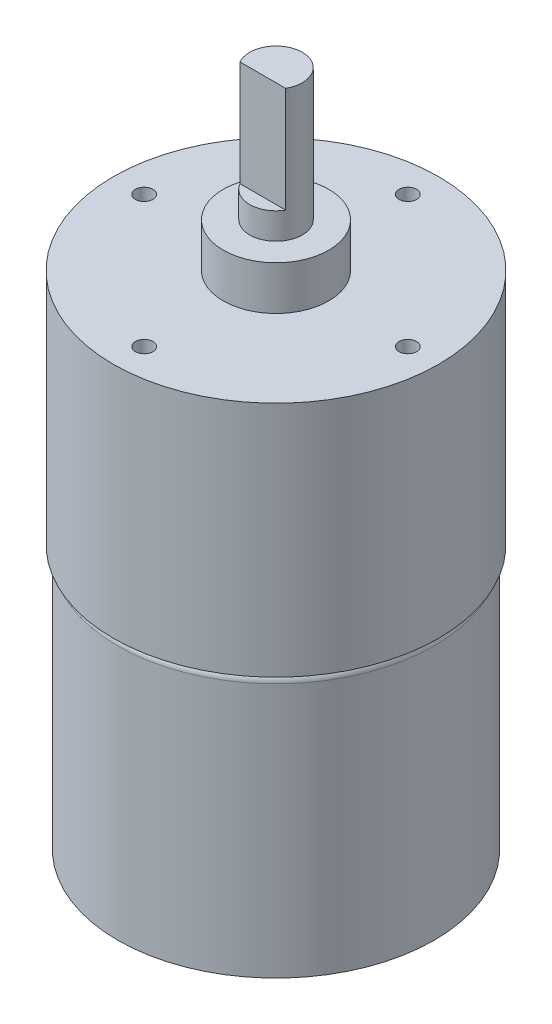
ISO-10303-21;
HEADER;
FILE_DESCRIPTION(('STEP AP214'),'2;1');
FILE_NAME('part.step','',(''),(''),'','','');
FILE_SCHEMA(('AUTOMOTIVE_DESIGN { 1 0 10303 214 1 1 1 1 }'));
ENDSEC;
DATA;
#1=APPLICATION_CONTEXT('core data for automotive mechanical design processes');
#2=APPLICATION_PROTOCOL_DEFINITION('international standard','automotive_design',2000,#1);
#3=PRODUCT_CONTEXT('',#1,'mechanical');
#4=PRODUCT('Part','Part','',(#3));
#5=PRODUCT_RELATED_PRODUCT_CATEGORY('part','',(#4));
#6=PRODUCT_DEFINITION_FORMATION('','',#4);
#7=PRODUCT_DEFINITION_CONTEXT('part definition',#1,'design');
#8=PRODUCT_DEFINITION('design','',#6,#7);
#9=PRODUCT_DEFINITION_SHAPE('','',#8);
#10=(LENGTH_UNIT() NAMED_UNIT(*) SI_UNIT(.MILLI.,.METRE.));
#11=(NAMED_UNIT(*) PLANE_ANGLE_UNIT() SI_UNIT($,.RADIAN.));
#12=(NAMED_UNIT(*) SI_UNIT($,.STERADIAN.) SOLID_ANGLE_UNIT());
#13=UNCERTAINTY_MEASURE_WITH_UNIT(LENGTH_MEASURE(1.E-05),#10,'distance_accuracy_value','');
#14=(GEOMETRIC_REPRESENTATION_CONTEXT(3) GLOBAL_UNCERTAINTY_ASSIGNED_CONTEXT((#13)) GLOBAL_UNIT_ASSIGNED_CONTEXT((#10,
#11,#12)) REPRESENTATION_CONTEXT('',''));
#15=CARTESIAN_POINT('',(0.,0.,0.));
#16=DIRECTION('',(0.,0.,1.));
#17=DIRECTION('',(1.,0.,0.));
#18=AXIS2_PLACEMENT_3D('',#15,#16,#17);
#19=CARTESIAN_POINT('',(3.5,-3.6,0.));
#20=DIRECTION('',(0.,1.,0.));
#21=DIRECTION('',(-1.,0.,0.));
#22=AXIS2_PLACEMENT_3D('',#19,#20,#21);
#23=PLANE('',#22);
#24=CARTESIAN_POINT('',(0.,-3.6,0.));
#25=DIRECTION('',(0.,1.,0.));
#26=DIRECTION('',(-1.,0.,0.));
#27=AXIS2_PLACEMENT_3D('',#24,#25,#26);
#28=CIRCLE('',#27,3.5);
#29=CARTESIAN_POINT('',(-3.5,-3.6,0.));
#30=VERTEX_POINT('',#29);
#31=EDGE_CURVE('E13',#30,#30,#28,.T.);
#32=ORIENTED_EDGE('',*,*,#31,.F.);
#33=EDGE_LOOP('',(#32));
#34=FACE_BOUND('',#33,.T.);
#35=ADVANCED_FACE('F58',(#34),#23,.F.);
#36=CARTESIAN_POINT('',(0.,0.,0.));
#37=DIRECTION('',(0.,1.,0.));
#38=DIRECTION('',(-1.,0.,0.));
#39=AXIS2_PLACEMENT_3D('',#36,#37,#38);
#40=CYLINDRICAL_SURFACE('',#39,3.5);
#41=CARTESIAN_POINT('',(0.,-4.,0.));
#42=DIRECTION('',(0.,1.,0.));
#43=DIRECTION('',(-1.,0.,0.));
#44=AXIS2_PLACEMENT_3D('',#41,#42,#43);
#45=CIRCLE('',#44,3.5);
#46=CARTESIAN_POINT('',(-3.5,-4.,0.));
#47=VERTEX_POINT('',#46);
#48=EDGE_CURVE('E64',#47,#47,#45,.T.);
#49=ORIENTED_EDGE('',*,*,#48,.F.);
#50=EDGE_LOOP('',(#49));
#51=FACE_BOUND('',#50,.T.);
#52=ORIENTED_EDGE('',*,*,#31,.T.);
#53=EDGE_LOOP('',(#52));
#54=FACE_BOUND('',#53,.T.);
#55=ADVANCED_FACE('F97',(#51,#54),#40,.F.);
#56=CARTESIAN_POINT('',(4.,-4.,0.));
#57=DIRECTION('',(0.,1.,0.));
#58=DIRECTION('',(-1.,0.,0.));
#59=AXIS2_PLACEMENT_3D('',#56,#57,#58);
#60=PLANE('',#59);
#61=CARTESIAN_POINT('',(0.,-4.,0.));
#62=DIRECTION('',(0.,1.,0.));
#63=DIRECTION('',(-1.,0.,0.));
#64=AXIS2_PLACEMENT_3D('',#61,#62,#63);
#65=CIRCLE('',#64,4.);
#66=CARTESIAN_POINT('',(-4.,-4.,0.));
#67=VERTEX_POINT('',#66);
#68=EDGE_CURVE('E68',#67,#67,#65,.T.);
#69=ORIENTED_EDGE('',*,*,#68,.F.);
#70=EDGE_LOOP('',(#69));
#71=FACE_BOUND('',#70,.T.);
#72=ORIENTED_EDGE('',*,*,#48,.T.);
#73=EDGE_LOOP('',(#72));
#74=FACE_BOUND('',#73,.T.);
#75=ADVANCED_FACE('F92',(#71,#74),#60,.F.);
#76=CARTESIAN_POINT('',(0.,-4.,0.));
#77=DIRECTION('',(0.,1.,0.));
#78=DIRECTION('',(-1.,0.,0.));
#79=AXIS2_PLACEMENT_3D('',#76,#77,#78);
#80=CONICAL_SURFACE('',#79,4.,0.785398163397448);
#81=CARTESIAN_POINT('',(0.,-3.,0.));
#82=DIRECTION('',(0.,1.,0.));
#83=DIRECTION('',(-1.,0.,0.));
#84=AXIS2_PLACEMENT_3D('',#81,#82,#83);
#85=CIRCLE('',#84,5.);
#86=CARTESIAN_POINT('',(-5.,-3.,0.));
#87=VERTEX_POINT('',#86);
#88=EDGE_CURVE('E72',#87,#87,#85,.T.);
#89=ORIENTED_EDGE('',*,*,#88,.F.);
#90=EDGE_LOOP('',(#89));
#91=FACE_BOUND('',#90,.T.);
#92=ORIENTED_EDGE('',*,*,#68,.T.);
#93=EDGE_LOOP('',(#92));
#94=FACE_BOUND('',#93,.T.);
#95=ADVANCED_FACE('F86',(#91,#94),#80,.T.);
#96=CARTESIAN_POINT('',(0.,0.,0.));
#97=DIRECTION('',(0.,1.,0.));
#98=DIRECTION('',(-1.,0.,0.));
#99=AXIS2_PLACEMENT_3D('',#96,#97,#98);
#100=CYLINDRICAL_SURFACE('',#99,5.);
#101=CARTESIAN_POINT('',(0.,0.,0.));
#102=DIRECTION('',(0.,1.,0.));
#103=DIRECTION('',(-1.,0.,0.));
#104=AXIS2_PLACEMENT_3D('',#101,#102,#103);
#105=CIRCLE('',#104,5.);
#106=CARTESIAN_POINT('',(-5.,0.,0.));
#107=VERTEX_POINT('',#106);
#108=EDGE_CURVE('E77',#107,#107,#105,.T.);
#109=ORIENTED_EDGE('',*,*,#108,.F.);
#110=EDGE_LOOP('',(#109));
#111=FACE_BOUND('',#110,.T.);
#112=ORIENTED_EDGE('',*,*,#88,.T.);
#113=EDGE_LOOP('',(#112));
#114=FACE_BOUND('',#113,.T.);
#115=ADVANCED_FACE('F83',(#111,#114),#100,.T.);
#116=CARTESIAN_POINT('',(5.,0.,0.));
#117=DIRECTION('',(0.,-1.,0.));
#118=DIRECTION('',(1.,0.,0.));
#119=AXIS2_PLACEMENT_3D('',#116,#117,#118);
#120=PLANE('',#119);
#121=ORIENTED_EDGE('',*,*,#108,.T.);
#122=EDGE_LOOP('',(#121));
#123=FACE_BOUND('',#122,.T.);
#124=ADVANCED_FACE('F81',(#123),#120,.F.);
#125=CLOSED_SHELL('',(#35,#55,#75,#95,#115,#124));
#126=MANIFOLD_SOLID_BREP('B2',#125);
#127=CARTESIAN_POINT('',(0.,30.,0.));
#128=DIRECTION('',(0.,-1.,0.));
#129=DIRECTION('',(0.,0.,-1.));
#130=AXIS2_PLACEMENT_3D('',#127,#128,#129);
#131=CYLINDRICAL_SURFACE('',#130,18.);
#132=CARTESIAN_POINT('',(0.,29.,0.));
#133=DIRECTION('',(0.,1.,0.));
#134=DIRECTION('',(0.,0.,1.));
#135=AXIS2_PLACEMENT_3D('',#132,#133,#134);
#136=CIRCLE('',#135,18.);
#137=CARTESIAN_POINT('',(0.,29.,18.));
#138=VERTEX_POINT('',#137);
#139=EDGE_CURVE('E157',#138,#138,#136,.F.);
#140=ORIENTED_EDGE('',*,*,#139,.T.);
#141=EDGE_LOOP('',(#140));
#142=FACE_BOUND('',#141,.T.);
#143=CARTESIAN_POINT('',(0.,0.,0.));
#144=DIRECTION('',(0.,1.,0.));
#145=DIRECTION('',(0.,0.,1.));
#146=AXIS2_PLACEMENT_3D('',#143,#144,#145);
#147=CIRCLE('',#146,18.);
#148=CARTESIAN_POINT('',(0.,0.,18.));
#149=VERTEX_POINT('',#148);
#150=EDGE_CURVE('E442',#149,#149,#147,.T.);
#151=ORIENTED_EDGE('',*,*,#150,.T.);
#152=EDGE_LOOP('',(#151));
#153=FACE_BOUND('',#152,.T.);
#154=ADVANCED_FACE('F149',(#142,#153),#131,.T.);
#155=CARTESIAN_POINT('',(0.,0.,0.));
#156=DIRECTION('',(0.,1.,0.));
#157=DIRECTION('',(0.,0.,1.));
#158=AXIS2_PLACEMENT_3D('',#155,#156,#157);
#159=PLANE('',#158);
#160=CARTESIAN_POINT('',(0.,0.,0.));
#161=DIRECTION('',(0.,-1.,0.));
#162=DIRECTION('',(0.,0.,-1.));
#163=AXIS2_PLACEMENT_3D('',#160,#161,#162);
#164=CIRCLE('',#163,17.5);
#165=CARTESIAN_POINT('',(0.,0.,-17.5));
#166=VERTEX_POINT('',#165);
#167=EDGE_CURVE('E438',#166,#166,#164,.T.);
#168=ORIENTED_EDGE('',*,*,#167,.F.);
#169=EDGE_LOOP('',(#168));
#170=FACE_BOUND('',#169,.T.);
#171=ORIENTED_EDGE('',*,*,#150,.F.);
#172=EDGE_LOOP('',(#171));
#173=FACE_BOUND('',#172,.T.);
#174=ADVANCED_FACE('F547',(#170,#173),#159,.F.);
#175=CARTESIAN_POINT('',(0.,1.,0.));
#176=DIRECTION('',(0.,-1.,0.));
#177=DIRECTION('',(0.,0.,-1.));
#178=AXIS2_PLACEMENT_3D('',#175,#176,#177);
#179=CYLINDRICAL_SURFACE('',#178,17.5);
#180=CARTESIAN_POINT('',(0.,1.,0.));
#181=DIRECTION('',(0.,-1.,0.));
#182=DIRECTION('',(0.,0.,-1.));
#183=AXIS2_PLACEMENT_3D('',#180,#181,#182);
#184=CIRCLE('',#183,17.5);
#185=CARTESIAN_POINT('',(0.,1.,-17.5));
#186=VERTEX_POINT('',#185);
#187=EDGE_CURVE('E439',#186,#186,#184,.T.);
#188=ORIENTED_EDGE('',*,*,#187,.F.);
#189=EDGE_LOOP('',(#188));
#190=FACE_BOUND('',#189,.T.);
#191=ORIENTED_EDGE('',*,*,#167,.T.);
#192=EDGE_LOOP('',(#191));
#193=FACE_BOUND('',#192,.T.);
#194=ADVANCED_FACE('F552',(#190,#193),#179,.F.);
#195=CARTESIAN_POINT('',(0.,1.,0.));
#196=DIRECTION('',(0.,-1.,0.));
#197=DIRECTION('',(0.,0.,-1.));
#198=AXIS2_PLACEMENT_3D('',#195,#196,#197);
#199=PLANE('',#198);
#200=CARTESIAN_POINT('',(10.5,1.,3.));
#201=DIRECTION('',(0.,-1.,0.));
#202=DIRECTION('',(0.,0.,-1.));
#203=AXIS2_PLACEMENT_3D('',#200,#201,#202);
#204=CIRCLE('',#203,0.500000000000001);
#205=CARTESIAN_POINT('',(10.5,1.,2.5));
#206=VERTEX_POINT('',#205);
#207=EDGE_CURVE('E381',#206,#206,#204,.T.);
#208=ORIENTED_EDGE('',*,*,#207,.F.);
#209=EDGE_LOOP('',(#208));
#210=FACE_BOUND('',#209,.T.);
#211=CARTESIAN_POINT('',(10.5,1.,-2.99999999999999));
#212=DIRECTION('',(0.,-1.,0.));
#213=DIRECTION('',(0.,0.,-1.));
#214=AXIS2_PLACEMENT_3D('',#211,#212,#213);
#215=CIRCLE('',#214,0.500000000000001);
#216=CARTESIAN_POINT('',(10.5,1.,-3.49999999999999));
#217=VERTEX_POINT('',#216);
#218=EDGE_CURVE('E450',#217,#217,#215,.T.);
#219=ORIENTED_EDGE('',*,*,#218,.F.);
#220=EDGE_LOOP('',(#219));
#221=FACE_BOUND('',#220,.T.);
#222=CARTESIAN_POINT('',(-10.5,1.,-2.99999999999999));
#223=DIRECTION('',(0.,-1.,0.));
#224=DIRECTION('',(0.,0.,-1.));
#225=AXIS2_PLACEMENT_3D('',#222,#223,#224);
#226=CIRCLE('',#225,0.500000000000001);
#227=CARTESIAN_POINT('',(-10.5,1.,-3.49999999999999));
#228=VERTEX_POINT('',#227);
#229=EDGE_CURVE('E390',#228,#228,#226,.T.);
#230=ORIENTED_EDGE('',*,*,#229,.F.);
#231=EDGE_LOOP('',(#230));
#232=FACE_BOUND('',#231,.T.);
#233=CARTESIAN_POINT('',(-10.5,1.,3.));
#234=DIRECTION('',(0.,-1.,0.));
#235=DIRECTION('',(0.,0.,-1.));
#236=AXIS2_PLACEMENT_3D('',#233,#234,#235);
#237=CIRCLE('',#236,0.500000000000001);
#238=CARTESIAN_POINT('',(-10.5,1.,2.5));
#239=VERTEX_POINT('',#238);
#240=EDGE_CURVE('E447',#239,#239,#237,.T.);
#241=ORIENTED_EDGE('',*,*,#240,.F.);
#242=EDGE_LOOP('',(#241));
#243=FACE_BOUND('',#242,.T.);
#244=CARTESIAN_POINT('',(11.,1.,1.5));
#245=DIRECTION('',(0.,-1.,0.));
#246=DIRECTION('',(0.,0.,-1.));
#247=AXIS2_PLACEMENT_3D('',#244,#245,#246);
#248=CIRCLE('',#247,0.5);
#249=CARTESIAN_POINT('',(11.5,1.,1.5));
#250=VERTEX_POINT('',#249);
#251=CARTESIAN_POINT('',(10.5,1.,1.5));
#252=VERTEX_POINT('',#251);
#253=EDGE_CURVE('E401',#250,#252,#248,.T.);
#254=ORIENTED_EDGE('',*,*,#253,.F.);
#255=DIRECTION('',(0.,0.,1.));
#256=VECTOR('',#255,1.);
#257=CARTESIAN_POINT('',(11.5,1.,0.));
#258=LINE('',#257,#256);
#259=CARTESIAN_POINT('',(11.5,1.,-1.5));
#260=VERTEX_POINT('',#259);
#261=EDGE_CURVE('E398',#260,#250,#258,.T.);
#262=ORIENTED_EDGE('',*,*,#261,.F.);
#263=CARTESIAN_POINT('',(11.,1.,-1.5));
#264=DIRECTION('',(0.,-1.,0.));
#265=DIRECTION('',(0.,0.,-1.));
#266=AXIS2_PLACEMENT_3D('',#263,#264,#265);
#267=CIRCLE('',#266,0.5);
#268=CARTESIAN_POINT('',(10.5,1.,-1.5));
#269=VERTEX_POINT('',#268);
#270=EDGE_CURVE('E407',#269,#260,#267,.T.);
#271=ORIENTED_EDGE('',*,*,#270,.F.);
#272=DIRECTION('',(0.,0.,1.));
#273=VECTOR('',#272,1.);
#274=CARTESIAN_POINT('',(10.5,1.,0.));
#275=LINE('',#274,#273);
#276=EDGE_CURVE('E404',#269,#252,#275,.T.);
#277=ORIENTED_EDGE('',*,*,#276,.T.);
#278=EDGE_LOOP('',(#254,#262,#271,#277));
#279=FACE_BOUND('',#278,.T.);
#280=CARTESIAN_POINT('',(-11.,1.,1.5));
#281=DIRECTION('',(0.,-1.,0.));
#282=DIRECTION('',(0.,0.,-1.));
#283=AXIS2_PLACEMENT_3D('',#280,#281,#282);
#284=CIRCLE('',#283,0.5);
#285=CARTESIAN_POINT('',(-10.5,1.,1.5));
#286=VERTEX_POINT('',#285);
#287=CARTESIAN_POINT('',(-11.5,1.,1.5));
#288=VERTEX_POINT('',#287);
#289=EDGE_CURVE('E421',#286,#288,#284,.T.);
#290=ORIENTED_EDGE('',*,*,#289,.F.);
#291=DIRECTION('',(0.,0.,1.));
#292=VECTOR('',#291,1.);
#293=CARTESIAN_POINT('',(-10.5,1.,0.));
#294=LINE('',#293,#292);
#295=CARTESIAN_POINT('',(-10.5,1.,-1.5));
#296=VERTEX_POINT('',#295);
#297=EDGE_CURVE('E418',#296,#286,#294,.T.);
#298=ORIENTED_EDGE('',*,*,#297,.F.);
#299=CARTESIAN_POINT('',(-11.,1.,-1.5));
#300=DIRECTION('',(0.,-1.,0.));
#301=DIRECTION('',(0.,0.,-1.));
#302=AXIS2_PLACEMENT_3D('',#299,#300,#301);
#303=CIRCLE('',#302,0.5);
#304=CARTESIAN_POINT('',(-11.5,1.,-1.5));
#305=VERTEX_POINT('',#304);
#306=EDGE_CURVE('E427',#305,#296,#303,.T.);
#307=ORIENTED_EDGE('',*,*,#306,.F.);
#308=DIRECTION('',(0.,0.,1.));
#309=VECTOR('',#308,1.);
#310=CARTESIAN_POINT('',(-11.5,1.,0.));
#311=LINE('',#310,#309);
#312=EDGE_CURVE('E424',#305,#288,#311,.T.);
#313=ORIENTED_EDGE('',*,*,#312,.T.);
#314=EDGE_LOOP('',(#290,#298,#307,#313));
#315=FACE_BOUND('',#314,.T.);
#316=ORIENTED_EDGE('',*,*,#187,.T.);
#317=EDGE_LOOP('',(#316));
#318=FACE_BOUND('',#317,.T.);
#319=ADVANCED_FACE('F614',(#210,#221,#232,#243,#279,#315,#318),#199,.T.);
#320=CARTESIAN_POINT('',(-10.5,-5.,0.));
#321=DIRECTION('',(-1.,0.,0.));
#322=DIRECTION('',(0.,0.,1.));
#323=AXIS2_PLACEMENT_3D('',#320,#321,#322);
#324=PLANE('',#323);
#325=CARTESIAN_POINT('',(-10.5,-3.25,0.));
#326=DIRECTION('',(-1.,0.,0.));
#327=DIRECTION('',(0.,0.,1.));
#328=AXIS2_PLACEMENT_3D('',#325,#326,#327);
#329=CIRCLE('',#328,0.5);
#330=CARTESIAN_POINT('',(-10.5,-3.25,-0.5));
#331=VERTEX_POINT('',#330);
#332=CARTESIAN_POINT('',(-10.5,-3.25,0.499999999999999));
#333=VERTEX_POINT('',#332);
#334=EDGE_CURVE('E354',#331,#333,#329,.T.);
#335=ORIENTED_EDGE('',*,*,#334,.T.);
#336=DIRECTION('',(0.,1.,0.));
#337=VECTOR('',#336,1.);
#338=CARTESIAN_POINT('',(-10.5,-5.,0.499999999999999));
#339=LINE('',#338,#337);
#340=CARTESIAN_POINT('',(-10.5,-1.75,0.5));
#341=VERTEX_POINT('',#340);
#342=EDGE_CURVE('E377',#333,#341,#339,.T.);
#343=ORIENTED_EDGE('',*,*,#342,.T.);
#344=CARTESIAN_POINT('',(-10.5,-1.75,0.));
#345=DIRECTION('',(-1.,0.,0.));
#346=DIRECTION('',(0.,0.,1.));
#347=AXIS2_PLACEMENT_3D('',#344,#345,#346);
#348=CIRCLE('',#347,0.5);
#349=CARTESIAN_POINT('',(-10.5,-1.75,-0.499999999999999));
#350=VERTEX_POINT('',#349);
#351=EDGE_CURVE('E369',#341,#350,#348,.T.);
#352=ORIENTED_EDGE('',*,*,#351,.T.);
#353=DIRECTION('',(0.,1.,0.));
#354=VECTOR('',#353,1.);
#355=CARTESIAN_POINT('',(-10.5,-5.,-0.5));
#356=LINE('',#355,#354);
#357=EDGE_CURVE('E362',#331,#350,#356,.T.);
#358=ORIENTED_EDGE('',*,*,#357,.F.);
#359=EDGE_LOOP('',(#335,#343,#352,#358));
#360=FACE_BOUND('',#359,.T.);
#361=DIRECTION('',(0.,1.,0.));
#362=VECTOR('',#361,1.);
#363=CARTESIAN_POINT('',(-10.5,-5.,1.5));
#364=LINE('',#363,#362);
#365=CARTESIAN_POINT('',(-10.5,-4.9,1.5));
#366=VERTEX_POINT('',#365);
#367=EDGE_CURVE('E436',#366,#286,#364,.T.);
#368=ORIENTED_EDGE('',*,*,#367,.F.);
#369=DIRECTION('',(0.,0.,-1.));
#370=VECTOR('',#369,1.);
#371=CARTESIAN_POINT('',(-10.5,-4.9,-1.5));
#372=LINE('',#371,#370);
#373=CARTESIAN_POINT('',(-10.5,-4.9,-1.5));
#374=VERTEX_POINT('',#373);
#375=EDGE_CURVE('E478',#366,#374,#372,.T.);
#376=ORIENTED_EDGE('',*,*,#375,.T.);
#377=DIRECTION('',(0.,1.,0.));
#378=VECTOR('',#377,1.);
#379=CARTESIAN_POINT('',(-10.5,-5.,-1.5));
#380=LINE('',#379,#378);
#381=EDGE_CURVE('E430',#374,#296,#380,.T.);
#382=ORIENTED_EDGE('',*,*,#381,.T.);
#383=ORIENTED_EDGE('',*,*,#297,.T.);
#384=EDGE_LOOP('',(#368,#376,#382,#383));
#385=FACE_BOUND('',#384,.T.);
#386=ADVANCED_FACE('F617',(#360,#385),#324,.F.);
#387=CARTESIAN_POINT('',(-11.,-5.,1.5));
#388=DIRECTION('',(0.,1.,0.));
#389=DIRECTION('',(0.,0.,1.));
#390=AXIS2_PLACEMENT_3D('',#387,#388,#389);
#391=CYLINDRICAL_SURFACE('',#390,0.5);
#392=DIRECTION('',(0.,1.,0.));
#393=VECTOR('',#392,1.);
#394=CARTESIAN_POINT('',(-11.5,-5.,1.5));
#395=LINE('',#394,#393);
#396=CARTESIAN_POINT('',(-11.5,-4.9,1.5));
#397=VERTEX_POINT('',#396);
#398=EDGE_CURVE('E434',#397,#288,#395,.T.);
#399=ORIENTED_EDGE('',*,*,#398,.F.);
#400=CARTESIAN_POINT('',(-11.,-4.9,1.5));
#401=DIRECTION('',(0.,-1.,0.));
#402=DIRECTION('',(0.,0.,-1.));
#403=AXIS2_PLACEMENT_3D('',#400,#401,#402);
#404=CIRCLE('',#403,0.5);
#405=EDGE_CURVE('E476',#397,#366,#404,.F.);
#406=ORIENTED_EDGE('',*,*,#405,.T.);
#407=ORIENTED_EDGE('',*,*,#367,.T.);
#408=ORIENTED_EDGE('',*,*,#289,.T.);
#409=EDGE_LOOP('',(#399,#406,#407,#408));
#410=FACE_BOUND('',#409,.T.);
#411=ADVANCED_FACE('F635',(#410),#391,.T.);
#412=CARTESIAN_POINT('',(-11.5,-5.,0.));
#413=DIRECTION('',(-1.,0.,0.));
#414=DIRECTION('',(0.,0.,1.));
#415=AXIS2_PLACEMENT_3D('',#412,#413,#414);
#416=PLANE('',#415);
#417=DIRECTION('',(0.,1.,0.));
#418=VECTOR('',#417,1.);
#419=CARTESIAN_POINT('',(-11.5,-5.,0.499999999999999));
#420=LINE('',#419,#418);
#421=CARTESIAN_POINT('',(-11.5,-3.25,0.499999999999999));
#422=VERTEX_POINT('',#421);
#423=CARTESIAN_POINT('',(-11.5,-1.75,0.5));
#424=VERTEX_POINT('',#423);
#425=EDGE_CURVE('E375',#422,#424,#420,.T.);
#426=ORIENTED_EDGE('',*,*,#425,.F.);
#427=CARTESIAN_POINT('',(-11.5,-3.25,0.));
#428=DIRECTION('',(-1.,0.,0.));
#429=DIRECTION('',(0.,0.,1.));
#430=AXIS2_PLACEMENT_3D('',#427,#428,#429);
#431=CIRCLE('',#430,0.5);
#432=CARTESIAN_POINT('',(-11.5,-3.25,-0.5));
#433=VERTEX_POINT('',#432);
#434=EDGE_CURVE('E352',#433,#422,#431,.T.);
#435=ORIENTED_EDGE('',*,*,#434,.F.);
#436=DIRECTION('',(0.,1.,0.));
#437=VECTOR('',#436,1.);
#438=CARTESIAN_POINT('',(-11.5,-5.,-0.5));
#439=LINE('',#438,#437);
#440=CARTESIAN_POINT('',(-11.5,-1.75,-0.499999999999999));
#441=VERTEX_POINT('',#440);
#442=EDGE_CURVE('E359',#433,#441,#439,.T.);
#443=ORIENTED_EDGE('',*,*,#442,.T.);
#444=CARTESIAN_POINT('',(-11.5,-1.75,0.));
#445=DIRECTION('',(-1.,0.,0.));
#446=DIRECTION('',(0.,0.,1.));
#447=AXIS2_PLACEMENT_3D('',#444,#445,#446);
#448=CIRCLE('',#447,0.5);
#449=EDGE_CURVE('E367',#424,#441,#448,.T.);
#450=ORIENTED_EDGE('',*,*,#449,.F.);
#451=EDGE_LOOP('',(#426,#435,#443,#450));
#452=FACE_BOUND('',#451,.T.);
#453=DIRECTION('',(0.,1.,0.));
#454=VECTOR('',#453,1.);
#455=CARTESIAN_POINT('',(-11.5,-5.,-1.5));
#456=LINE('',#455,#454);
#457=CARTESIAN_POINT('',(-11.5,-4.9,-1.5));
#458=VERTEX_POINT('',#457);
#459=EDGE_CURVE('E432',#458,#305,#456,.T.);
#460=ORIENTED_EDGE('',*,*,#459,.F.);
#461=DIRECTION('',(0.,0.,1.));
#462=VECTOR('',#461,1.);
#463=CARTESIAN_POINT('',(-11.5,-4.9,0.));
#464=LINE('',#463,#462);
#465=EDGE_CURVE('E474',#458,#397,#464,.T.);
#466=ORIENTED_EDGE('',*,*,#465,.T.);
#467=ORIENTED_EDGE('',*,*,#398,.T.);
#468=ORIENTED_EDGE('',*,*,#312,.F.);
#469=EDGE_LOOP('',(#460,#466,#467,#468));
#470=FACE_BOUND('',#469,.T.);
#471=ADVANCED_FACE('F639',(#452,#470),#416,.T.);
#472=CARTESIAN_POINT('',(-11.,-5.,-1.5));
#473=DIRECTION('',(0.,1.,0.));
#474=DIRECTION('',(0.,0.,1.));
#475=AXIS2_PLACEMENT_3D('',#472,#473,#474);
#476=CYLINDRICAL_SURFACE('',#475,0.5);
#477=ORIENTED_EDGE('',*,*,#381,.F.);
#478=CARTESIAN_POINT('',(-11.,-4.9,-1.5));
#479=DIRECTION('',(0.,-1.,0.));
#480=DIRECTION('',(0.,0.,-1.));
#481=AXIS2_PLACEMENT_3D('',#478,#479,#480);
#482=CIRCLE('',#481,0.5);
#483=EDGE_CURVE('E471',#374,#458,#482,.F.);
#484=ORIENTED_EDGE('',*,*,#483,.T.);
#485=ORIENTED_EDGE('',*,*,#459,.T.);
#486=ORIENTED_EDGE('',*,*,#306,.T.);
#487=EDGE_LOOP('',(#477,#484,#485,#486));
#488=FACE_BOUND('',#487,.T.);
#489=ADVANCED_FACE('F643',(#488),#476,.T.);
#490=CARTESIAN_POINT('',(0.,-5.,0.));
#491=DIRECTION('',(0.,-1.,0.));
#492=DIRECTION('',(0.,0.,-1.));
#493=AXIS2_PLACEMENT_3D('',#490,#491,#492);
#494=PLANE('',#493);
#495=DIRECTION('',(0.,0.,-1.));
#496=VECTOR('',#495,1.);
#497=CARTESIAN_POINT('',(-11.4,-5.,0.));
#498=LINE('',#497,#496);
#499=CARTESIAN_POINT('',(-11.4,-5.,1.5));
#500=VERTEX_POINT('',#499);
#501=CARTESIAN_POINT('',(-11.4,-5.,-1.5));
#502=VERTEX_POINT('',#501);
#503=EDGE_CURVE('E466',#500,#502,#498,.T.);
#504=ORIENTED_EDGE('',*,*,#503,.T.);
#505=CARTESIAN_POINT('',(-11.,-5.,-1.5));
#506=DIRECTION('',(0.,-1.,0.));
#507=DIRECTION('',(0.,0.,-1.));
#508=AXIS2_PLACEMENT_3D('',#505,#506,#507);
#509=CIRCLE('',#508,0.399999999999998);
#510=CARTESIAN_POINT('',(-10.6,-5.,-1.5));
#511=VERTEX_POINT('',#510);
#512=EDGE_CURVE('E468',#502,#511,#509,.T.);
#513=ORIENTED_EDGE('',*,*,#512,.T.);
#514=DIRECTION('',(0.,0.,1.));
#515=VECTOR('',#514,1.);
#516=CARTESIAN_POINT('',(-10.6,-5.,1.5));
#517=LINE('',#516,#515);
#518=CARTESIAN_POINT('',(-10.6,-5.,1.5));
#519=VERTEX_POINT('',#518);
#520=EDGE_CURVE('E462',#511,#519,#517,.T.);
#521=ORIENTED_EDGE('',*,*,#520,.T.);
#522=CARTESIAN_POINT('',(-11.,-5.,1.5));
#523=DIRECTION('',(0.,-1.,0.));
#524=DIRECTION('',(0.,0.,-1.));
#525=AXIS2_PLACEMENT_3D('',#522,#523,#524);
#526=CIRCLE('',#525,0.399999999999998);
#527=EDGE_CURVE('E464',#519,#500,#526,.T.);
#528=ORIENTED_EDGE('',*,*,#527,.T.);
#529=EDGE_LOOP('',(#504,#513,#521,#528));
#530=FACE_BOUND('',#529,.T.);
#531=ADVANCED_FACE('F647',(#530),#494,.T.);
#532=CARTESIAN_POINT('',(11.5,-5.,0.));
#533=DIRECTION('',(-1.,0.,0.));
#534=DIRECTION('',(0.,0.,1.));
#535=AXIS2_PLACEMENT_3D('',#532,#533,#534);
#536=PLANE('',#535);
#537=CARTESIAN_POINT('',(11.5,-3.25,0.));
#538=DIRECTION('',(-1.,0.,0.));
#539=DIRECTION('',(0.,0.,1.));
#540=AXIS2_PLACEMENT_3D('',#537,#538,#539);
#541=CIRCLE('',#540,0.5);
#542=CARTESIAN_POINT('',(11.5,-3.25,-0.5));
#543=VERTEX_POINT('',#542);
#544=CARTESIAN_POINT('',(11.5,-3.25,0.499999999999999));
#545=VERTEX_POINT('',#544);
#546=EDGE_CURVE('E349',#543,#545,#541,.T.);
#547=ORIENTED_EDGE('',*,*,#546,.T.);
#548=DIRECTION('',(0.,1.,0.));
#549=VECTOR('',#548,1.);
#550=CARTESIAN_POINT('',(11.5,-5.,0.499999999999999));
#551=LINE('',#550,#549);
#552=CARTESIAN_POINT('',(11.5,-1.75,0.5));
#553=VERTEX_POINT('',#552);
#554=EDGE_CURVE('E372',#545,#553,#551,.T.);
#555=ORIENTED_EDGE('',*,*,#554,.T.);
#556=CARTESIAN_POINT('',(11.5,-1.75,0.));
#557=DIRECTION('',(-1.,0.,0.));
#558=DIRECTION('',(0.,0.,1.));
#559=AXIS2_PLACEMENT_3D('',#556,#557,#558);
#560=CIRCLE('',#559,0.5);
#561=CARTESIAN_POINT('',(11.5,-1.75,-0.499999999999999));
#562=VERTEX_POINT('',#561);
#563=EDGE_CURVE('E364',#553,#562,#560,.T.);
#564=ORIENTED_EDGE('',*,*,#563,.T.);
#565=DIRECTION('',(0.,1.,0.));
#566=VECTOR('',#565,1.);
#567=CARTESIAN_POINT('',(11.5,-5.,-0.5));
#568=LINE('',#567,#566);
#569=EDGE_CURVE('E357',#543,#562,#568,.T.);
#570=ORIENTED_EDGE('',*,*,#569,.F.);
#571=EDGE_LOOP('',(#547,#555,#564,#570));
#572=FACE_BOUND('',#571,.T.);
#573=DIRECTION('',(0.,1.,0.));
#574=VECTOR('',#573,1.);
#575=CARTESIAN_POINT('',(11.5,-5.,1.5));
#576=LINE('',#575,#574);
#577=CARTESIAN_POINT('',(11.5,-4.90000000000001,1.5));
#578=VERTEX_POINT('',#577);
#579=EDGE_CURVE('E416',#578,#250,#576,.T.);
#580=ORIENTED_EDGE('',*,*,#579,.F.);
#581=DIRECTION('',(0.,0.,-1.));
#582=VECTOR('',#581,1.);
#583=CARTESIAN_POINT('',(11.5,-4.90000000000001,-1.5));
#584=LINE('',#583,#582);
#585=CARTESIAN_POINT('',(11.5,-4.90000000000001,-1.5));
#586=VERTEX_POINT('',#585);
#587=EDGE_CURVE('E495',#578,#586,#584,.T.);
#588=ORIENTED_EDGE('',*,*,#587,.T.);
#589=DIRECTION('',(0.,1.,0.));
#590=VECTOR('',#589,1.);
#591=CARTESIAN_POINT('',(11.5,-5.,-1.5));
#592=LINE('',#591,#590);
#593=EDGE_CURVE('E410',#586,#260,#592,.T.);
#594=ORIENTED_EDGE('',*,*,#593,.T.);
#595=ORIENTED_EDGE('',*,*,#261,.T.);
#596=EDGE_LOOP('',(#580,#588,#594,#595));
#597=FACE_BOUND('',#596,.T.);
#598=ADVANCED_FACE('F597',(#572,#597),#536,.F.);
#599=CARTESIAN_POINT('',(11.,-5.,1.5));
#600=DIRECTION('',(0.,1.,0.));
#601=DIRECTION('',(0.,0.,1.));
#602=AXIS2_PLACEMENT_3D('',#599,#600,#601);
#603=CYLINDRICAL_SURFACE('',#602,0.5);
#604=DIRECTION('',(0.,1.,0.));
#605=VECTOR('',#604,1.);
#606=CARTESIAN_POINT('',(10.5,-5.,1.5));
#607=LINE('',#606,#605);
#608=CARTESIAN_POINT('',(10.5,-4.90000000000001,1.5));
#609=VERTEX_POINT('',#608);
#610=EDGE_CURVE('E414',#609,#252,#607,.T.);
#611=ORIENTED_EDGE('',*,*,#610,.F.);
#612=CARTESIAN_POINT('',(11.,-4.90000000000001,1.5));
#613=DIRECTION('',(0.,-1.,0.));
#614=DIRECTION('',(0.,0.,-1.));
#615=AXIS2_PLACEMENT_3D('',#612,#613,#614);
#616=CIRCLE('',#615,0.5);
#617=EDGE_CURVE('E172',#609,#578,#616,.F.);
#618=ORIENTED_EDGE('',*,*,#617,.T.);
#619=ORIENTED_EDGE('',*,*,#579,.T.);
#620=ORIENTED_EDGE('',*,*,#253,.T.);
#621=EDGE_LOOP('',(#611,#618,#619,#620));
#622=FACE_BOUND('',#621,.T.);
#623=ADVANCED_FACE('F611',(#622),#603,.T.);
#624=CARTESIAN_POINT('',(10.5,-5.,0.));
#625=DIRECTION('',(-1.,0.,0.));
#626=DIRECTION('',(0.,0.,1.));
#627=AXIS2_PLACEMENT_3D('',#624,#625,#626);
#628=PLANE('',#627);
#629=DIRECTION('',(0.,1.,0.));
#630=VECTOR('',#629,1.);
#631=CARTESIAN_POINT('',(10.5,-5.,0.499999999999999));
#632=LINE('',#631,#630);
#633=CARTESIAN_POINT('',(10.5,-3.25,0.499999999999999));
#634=VERTEX_POINT('',#633);
#635=CARTESIAN_POINT('',(10.5,-1.75,0.5));
#636=VERTEX_POINT('',#635);
#637=EDGE_CURVE('E460',#634,#636,#632,.T.);
#638=ORIENTED_EDGE('',*,*,#637,.F.);
#639=CARTESIAN_POINT('',(10.5,-3.25,0.));
#640=DIRECTION('',(-1.,0.,0.));
#641=DIRECTION('',(0.,0.,1.));
#642=AXIS2_PLACEMENT_3D('',#639,#640,#641);
#643=CIRCLE('',#642,0.5);
#644=CARTESIAN_POINT('',(10.5,-3.25,-0.5));
#645=VERTEX_POINT('',#644);
#646=EDGE_CURVE('E453',#645,#634,#643,.T.);
#647=ORIENTED_EDGE('',*,*,#646,.F.);
#648=DIRECTION('',(0.,1.,0.));
#649=VECTOR('',#648,1.);
#650=CARTESIAN_POINT('',(10.5,-5.,-0.5));
#651=LINE('',#650,#649);
#652=CARTESIAN_POINT('',(10.5,-1.75,-0.499999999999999));
#653=VERTEX_POINT('',#652);
#654=EDGE_CURVE('E455',#645,#653,#651,.T.);
#655=ORIENTED_EDGE('',*,*,#654,.T.);
#656=CARTESIAN_POINT('',(10.5,-1.75,0.));
#657=DIRECTION('',(-1.,0.,0.));
#658=DIRECTION('',(0.,0.,1.));
#659=AXIS2_PLACEMENT_3D('',#656,#657,#658);
#660=CIRCLE('',#659,0.5);
#661=EDGE_CURVE('E458',#636,#653,#660,.T.);
#662=ORIENTED_EDGE('',*,*,#661,.F.);
#663=EDGE_LOOP('',(#638,#647,#655,#662));
#664=FACE_BOUND('',#663,.T.);
#665=DIRECTION('',(0.,1.,0.));
#666=VECTOR('',#665,1.);
#667=CARTESIAN_POINT('',(10.5,-5.,-1.5));
#668=LINE('',#667,#666);
#669=CARTESIAN_POINT('',(10.5,-4.90000000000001,-1.5));
#670=VERTEX_POINT('',#669);
#671=EDGE_CURVE('E412',#670,#269,#668,.T.);
#672=ORIENTED_EDGE('',*,*,#671,.F.);
#673=DIRECTION('',(0.,0.,1.));
#674=VECTOR('',#673,1.);
#675=CARTESIAN_POINT('',(10.5,-4.90000000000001,0.));
#676=LINE('',#675,#674);
#677=EDGE_CURVE('E492',#670,#609,#676,.T.);
#678=ORIENTED_EDGE('',*,*,#677,.T.);
#679=ORIENTED_EDGE('',*,*,#610,.T.);
#680=ORIENTED_EDGE('',*,*,#276,.F.);
#681=EDGE_LOOP('',(#672,#678,#679,#680));
#682=FACE_BOUND('',#681,.T.);
#683=ADVANCED_FACE('F609',(#664,#682),#628,.T.);
#684=CARTESIAN_POINT('',(11.,-5.,-1.5));
#685=DIRECTION('',(0.,1.,0.));
#686=DIRECTION('',(0.,0.,1.));
#687=AXIS2_PLACEMENT_3D('',#684,#685,#686);
#688=CYLINDRICAL_SURFACE('',#687,0.5);
#689=ORIENTED_EDGE('',*,*,#593,.F.);
#690=CARTESIAN_POINT('',(11.,-4.90000000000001,-1.5));
#691=DIRECTION('',(0.,-1.,0.));
#692=DIRECTION('',(0.,0.,-1.));
#693=AXIS2_PLACEMENT_3D('',#690,#691,#692);
#694=CIRCLE('',#693,0.5);
#695=EDGE_CURVE('E489',#586,#670,#694,.F.);
#696=ORIENTED_EDGE('',*,*,#695,.T.);
#697=ORIENTED_EDGE('',*,*,#671,.T.);
#698=ORIENTED_EDGE('',*,*,#270,.T.);
#699=EDGE_LOOP('',(#689,#696,#697,#698));
#700=FACE_BOUND('',#699,.T.);
#701=ADVANCED_FACE('F600',(#700),#688,.T.);
#702=CARTESIAN_POINT('',(0.,-5.,0.));
#703=DIRECTION('',(0.,-1.,0.));
#704=DIRECTION('',(0.,0.,-1.));
#705=AXIS2_PLACEMENT_3D('',#702,#703,#704);
#706=PLANE('',#705);
#707=DIRECTION('',(0.,0.,-1.));
#708=VECTOR('',#707,1.);
#709=CARTESIAN_POINT('',(10.6,-5.,0.));
#710=LINE('',#709,#708);
#711=CARTESIAN_POINT('',(10.6,-5.,1.5));
#712=VERTEX_POINT('',#711);
#713=CARTESIAN_POINT('',(10.6,-5.,-1.5));
#714=VERTEX_POINT('',#713);
#715=EDGE_CURVE('E484',#712,#714,#710,.T.);
#716=ORIENTED_EDGE('',*,*,#715,.T.);
#717=CARTESIAN_POINT('',(11.,-5.,-1.5));
#718=DIRECTION('',(0.,-1.,0.));
#719=DIRECTION('',(0.,0.,-1.));
#720=AXIS2_PLACEMENT_3D('',#717,#718,#719);
#721=CIRCLE('',#720,0.400000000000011);
#722=CARTESIAN_POINT('',(11.4,-5.,-1.5));
#723=VERTEX_POINT('',#722);
#724=EDGE_CURVE('E486',#714,#723,#721,.T.);
#725=ORIENTED_EDGE('',*,*,#724,.T.);
#726=DIRECTION('',(0.,0.,1.));
#727=VECTOR('',#726,1.);
#728=CARTESIAN_POINT('',(11.4,-5.,1.5));
#729=LINE('',#728,#727);
#730=CARTESIAN_POINT('',(11.4,-5.,1.5));
#731=VERTEX_POINT('',#730);
#732=EDGE_CURVE('E480',#723,#731,#729,.T.);
#733=ORIENTED_EDGE('',*,*,#732,.T.);
#734=CARTESIAN_POINT('',(11.,-5.,1.5));
#735=DIRECTION('',(0.,-1.,0.));
#736=DIRECTION('',(0.,0.,-1.));
#737=AXIS2_PLACEMENT_3D('',#734,#735,#736);
#738=CIRCLE('',#737,0.400000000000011);
#739=EDGE_CURVE('E482',#731,#712,#738,.T.);
#740=ORIENTED_EDGE('',*,*,#739,.T.);
#741=EDGE_LOOP('',(#716,#725,#733,#740));
#742=FACE_BOUND('',#741,.T.);
#743=ADVANCED_FACE('F662',(#742),#706,.T.);
#744=CARTESIAN_POINT('',(-10.5,0.5,3.));
#745=DIRECTION('',(0.,1.,0.));
#746=DIRECTION('',(0.,0.,1.));
#747=AXIS2_PLACEMENT_3D('',#744,#745,#746);
#748=CYLINDRICAL_SURFACE('',#747,0.500000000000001);
#749=CARTESIAN_POINT('',(-10.5,0.5,3.));
#750=DIRECTION('',(0.,1.,0.));
#751=DIRECTION('',(0.,0.,1.));
#752=AXIS2_PLACEMENT_3D('',#749,#750,#751);
#753=CIRCLE('',#752,0.500000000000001);
#754=CARTESIAN_POINT('',(-10.5,0.5,3.5));
#755=VERTEX_POINT('',#754);
#756=EDGE_CURVE('E393',#755,#755,#753,.T.);
#757=ORIENTED_EDGE('',*,*,#756,.T.);
#758=EDGE_LOOP('',(#757));
#759=FACE_BOUND('',#758,.T.);
#760=ORIENTED_EDGE('',*,*,#240,.T.);
#761=EDGE_LOOP('',(#760));
#762=FACE_BOUND('',#761,.T.);
#763=ADVANCED_FACE('F665',(#759,#762),#748,.T.);
#764=CARTESIAN_POINT('',(-10.5,0.5,3.));
#765=DIRECTION('',(0.,1.,0.));
#766=DIRECTION('',(0.,0.,1.));
#767=AXIS2_PLACEMENT_3D('',#764,#765,#766);
#768=PLANE('',#767);
#769=ORIENTED_EDGE('',*,*,#756,.F.);
#770=EDGE_LOOP('',(#769));
#771=FACE_BOUND('',#770,.T.);
#772=ADVANCED_FACE('F669',(#771),#768,.F.);
#773=CARTESIAN_POINT('',(-10.5,0.5,-2.99999999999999));
#774=DIRECTION('',(0.,1.,0.));
#775=DIRECTION('',(0.,0.,1.));
#776=AXIS2_PLACEMENT_3D('',#773,#774,#775);
#777=CYLINDRICAL_SURFACE('',#776,0.500000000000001);
#778=CARTESIAN_POINT('',(-10.5,0.5,-2.99999999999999));
#779=DIRECTION('',(0.,-1.,0.));
#780=DIRECTION('',(0.,0.,-1.));
#781=AXIS2_PLACEMENT_3D('',#778,#779,#780);
#782=CIRCLE('',#781,0.500000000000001);
#783=CARTESIAN_POINT('',(-10.5,0.5,-3.49999999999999));
#784=VERTEX_POINT('',#783);
#785=EDGE_CURVE('E389',#784,#784,#782,.T.);
#786=ORIENTED_EDGE('',*,*,#785,.F.);
#787=EDGE_LOOP('',(#786));
#788=FACE_BOUND('',#787,.T.);
#789=ORIENTED_EDGE('',*,*,#229,.T.);
#790=EDGE_LOOP('',(#789));
#791=FACE_BOUND('',#790,.T.);
#792=ADVANCED_FACE('F673',(#788,#791),#777,.T.);
#793=CARTESIAN_POINT('',(-10.5,0.5,-2.99999999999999));
#794=DIRECTION('',(0.,-1.,0.));
#795=DIRECTION('',(0.,0.,-1.));
#796=AXIS2_PLACEMENT_3D('',#793,#794,#795);
#797=PLANE('',#796);
#798=ORIENTED_EDGE('',*,*,#785,.T.);
#799=EDGE_LOOP('',(#798));
#800=FACE_BOUND('',#799,.T.);
#801=ADVANCED_FACE('F675',(#800),#797,.T.);
#802=CARTESIAN_POINT('',(10.5,0.5,-2.99999999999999));
#803=DIRECTION('',(0.,1.,0.));
#804=DIRECTION('',(0.,0.,1.));
#805=AXIS2_PLACEMENT_3D('',#802,#803,#804);
#806=CYLINDRICAL_SURFACE('',#805,0.500000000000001);
#807=CARTESIAN_POINT('',(10.5,0.5,-2.99999999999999));
#808=DIRECTION('',(0.,1.,0.));
#809=DIRECTION('',(0.,0.,1.));
#810=AXIS2_PLACEMENT_3D('',#807,#808,#809);
#811=CIRCLE('',#810,0.500000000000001);
#812=CARTESIAN_POINT('',(10.5,0.5,-2.49999999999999));
#813=VERTEX_POINT('',#812);
#814=EDGE_CURVE('E384',#813,#813,#811,.T.);
#815=ORIENTED_EDGE('',*,*,#814,.T.);
#816=EDGE_LOOP('',(#815));
#817=FACE_BOUND('',#816,.T.);
#818=ORIENTED_EDGE('',*,*,#218,.T.);
#819=EDGE_LOOP('',(#818));
#820=FACE_BOUND('',#819,.T.);
#821=ADVANCED_FACE('F678',(#817,#820),#806,.T.);
#822=CARTESIAN_POINT('',(10.5,0.5,-2.99999999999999));
#823=DIRECTION('',(0.,1.,0.));
#824=DIRECTION('',(0.,0.,1.));
#825=AXIS2_PLACEMENT_3D('',#822,#823,#824);
#826=PLANE('',#825);
#827=ORIENTED_EDGE('',*,*,#814,.F.);
#828=EDGE_LOOP('',(#827));
#829=FACE_BOUND('',#828,.T.);
#830=ADVANCED_FACE('F683',(#829),#826,.F.);
#831=CARTESIAN_POINT('',(10.5,0.5,3.));
#832=DIRECTION('',(0.,1.,0.));
#833=DIRECTION('',(0.,0.,1.));
#834=AXIS2_PLACEMENT_3D('',#831,#832,#833);
#835=CYLINDRICAL_SURFACE('',#834,0.500000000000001);
#836=CARTESIAN_POINT('',(10.5,0.5,3.));
#837=DIRECTION('',(0.,-1.,0.));
#838=DIRECTION('',(0.,0.,-1.));
#839=AXIS2_PLACEMENT_3D('',#836,#837,#838);
#840=CIRCLE('',#839,0.500000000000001);
#841=CARTESIAN_POINT('',(10.5,0.5,2.5));
#842=VERTEX_POINT('',#841);
#843=EDGE_CURVE('E380',#842,#842,#840,.T.);
#844=ORIENTED_EDGE('',*,*,#843,.F.);
#845=EDGE_LOOP('',(#844));
#846=FACE_BOUND('',#845,.T.);
#847=ORIENTED_EDGE('',*,*,#207,.T.);
#848=EDGE_LOOP('',(#847));
#849=FACE_BOUND('',#848,.T.);
#850=ADVANCED_FACE('F686',(#846,#849),#835,.T.);
#851=CARTESIAN_POINT('',(10.5,0.5,3.));
#852=DIRECTION('',(0.,-1.,0.));
#853=DIRECTION('',(0.,0.,-1.));
#854=AXIS2_PLACEMENT_3D('',#851,#852,#853);
#855=PLANE('',#854);
#856=ORIENTED_EDGE('',*,*,#843,.T.);
#857=EDGE_LOOP('',(#856));
#858=FACE_BOUND('',#857,.T.);
#859=ADVANCED_FACE('F691',(#858),#855,.T.);
#860=CARTESIAN_POINT('',(-18.,-3.25,0.));
#861=DIRECTION('',(1.,0.,0.));
#862=DIRECTION('',(0.,0.,-1.));
#863=AXIS2_PLACEMENT_3D('',#860,#861,#862);
#864=CYLINDRICAL_SURFACE('',#863,0.5);
#865=DIRECTION('',(1.,0.,0.));
#866=VECTOR('',#865,1.);
#867=CARTESIAN_POINT('',(-18.,-3.25,-0.5));
#868=LINE('',#867,#866);
#869=EDGE_CURVE('E342',#645,#543,#868,.T.);
#870=ORIENTED_EDGE('',*,*,#869,.F.);
#871=ORIENTED_EDGE('',*,*,#646,.T.);
#872=DIRECTION('',(1.,0.,0.));
#873=VECTOR('',#872,1.);
#874=CARTESIAN_POINT('',(-18.,-3.25,0.499999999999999));
#875=LINE('',#874,#873);
#876=EDGE_CURVE('E346',#634,#545,#875,.T.);
#877=ORIENTED_EDGE('',*,*,#876,.T.);
#878=ORIENTED_EDGE('',*,*,#546,.F.);
#879=EDGE_LOOP('',(#870,#871,#877,#878));
#880=FACE_BOUND('',#879,.T.);
#881=ADVANCED_FACE('F694',(#880),#864,.F.);
#882=CARTESIAN_POINT('',(-18.,-1.75,-0.499999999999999));
#883=DIRECTION('',(0.,0.,1.));
#884=DIRECTION('',(0.,-1.,0.));
#885=AXIS2_PLACEMENT_3D('',#882,#883,#884);
#886=PLANE('',#885);
#887=ORIENTED_EDGE('',*,*,#569,.T.);
#888=DIRECTION('',(1.,0.,0.));
#889=VECTOR('',#888,1.);
#890=CARTESIAN_POINT('',(-18.,-1.75,-0.499999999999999));
#891=LINE('',#890,#889);
#892=EDGE_CURVE('E338',#653,#562,#891,.T.);
#893=ORIENTED_EDGE('',*,*,#892,.F.);
#894=ORIENTED_EDGE('',*,*,#654,.F.);
#895=ORIENTED_EDGE('',*,*,#869,.T.);
#896=EDGE_LOOP('',(#887,#893,#894,#895));
#897=FACE_BOUND('',#896,.T.);
#898=ADVANCED_FACE('F711',(#897),#886,.T.);
#899=CARTESIAN_POINT('',(-18.,-1.75,0.));
#900=DIRECTION('',(1.,0.,0.));
#901=DIRECTION('',(0.,0.,-1.));
#902=AXIS2_PLACEMENT_3D('',#899,#900,#901);
#903=CYLINDRICAL_SURFACE('',#902,0.5);
#904=DIRECTION('',(1.,0.,0.));
#905=VECTOR('',#904,1.);
#906=CARTESIAN_POINT('',(-18.,-1.75,0.5));
#907=LINE('',#906,#905);
#908=EDGE_CURVE('E333',#636,#553,#907,.T.);
#909=ORIENTED_EDGE('',*,*,#908,.F.);
#910=ORIENTED_EDGE('',*,*,#661,.T.);
#911=ORIENTED_EDGE('',*,*,#892,.T.);
#912=ORIENTED_EDGE('',*,*,#563,.F.);
#913=EDGE_LOOP('',(#909,#910,#911,#912));
#914=FACE_BOUND('',#913,.T.);
#915=ADVANCED_FACE('F714',(#914),#903,.F.);
#916=CARTESIAN_POINT('',(-18.,-1.75,0.5));
#917=DIRECTION('',(0.,0.,1.));
#918=DIRECTION('',(0.,-1.,0.));
#919=AXIS2_PLACEMENT_3D('',#916,#917,#918);
#920=PLANE('',#919);
#921=ORIENTED_EDGE('',*,*,#876,.F.);
#922=ORIENTED_EDGE('',*,*,#637,.T.);
#923=ORIENTED_EDGE('',*,*,#908,.T.);
#924=ORIENTED_EDGE('',*,*,#554,.F.);
#925=EDGE_LOOP('',(#921,#922,#923,#924));
#926=FACE_BOUND('',#925,.T.);
#927=ADVANCED_FACE('F703',(#926),#920,.F.);
#928=EDGE_CURVE('E345',#422,#333,#875,.T.);
#929=ORIENTED_EDGE('',*,*,#928,.F.);
#930=ORIENTED_EDGE('',*,*,#425,.T.);
#931=EDGE_CURVE('E336',#424,#341,#907,.T.);
#932=ORIENTED_EDGE('',*,*,#931,.T.);
#933=ORIENTED_EDGE('',*,*,#342,.F.);
#934=EDGE_LOOP('',(#929,#930,#932,#933));
#935=FACE_BOUND('',#934,.T.);
#936=ADVANCED_FACE('F699',(#935),#920,.F.);
#937=ORIENTED_EDGE('',*,*,#931,.F.);
#938=ORIENTED_EDGE('',*,*,#449,.T.);
#939=EDGE_CURVE('E337',#441,#350,#891,.T.);
#940=ORIENTED_EDGE('',*,*,#939,.T.);
#941=ORIENTED_EDGE('',*,*,#351,.F.);
#942=EDGE_LOOP('',(#937,#938,#940,#941));
#943=FACE_BOUND('',#942,.T.);
#944=ADVANCED_FACE('F702',(#943),#903,.F.);
#945=ORIENTED_EDGE('',*,*,#357,.T.);
#946=ORIENTED_EDGE('',*,*,#939,.F.);
#947=ORIENTED_EDGE('',*,*,#442,.F.);
#948=EDGE_CURVE('E341',#433,#331,#868,.T.);
#949=ORIENTED_EDGE('',*,*,#948,.T.);
#950=EDGE_LOOP('',(#945,#946,#947,#949));
#951=FACE_BOUND('',#950,.T.);
#952=ADVANCED_FACE('F707',(#951),#886,.T.);
#953=ORIENTED_EDGE('',*,*,#948,.F.);
#954=ORIENTED_EDGE('',*,*,#434,.T.);
#955=ORIENTED_EDGE('',*,*,#928,.T.);
#956=ORIENTED_EDGE('',*,*,#334,.F.);
#957=EDGE_LOOP('',(#953,#954,#955,#956));
#958=FACE_BOUND('',#957,.T.);
#959=ADVANCED_FACE('F573',(#958),#864,.F.);
#960=CARTESIAN_POINT('',(-11.,-5.,1.5));
#961=DIRECTION('',(0.,1.,0.));
#962=DIRECTION('',(0.,0.,1.));
#963=AXIS2_PLACEMENT_3D('',#960,#961,#962);
#964=CONICAL_SURFACE('',#963,0.399999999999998,0.785398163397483);
#965=DIRECTION('',(-0.707106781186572,-0.707106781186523,0.));
#966=VECTOR('',#965,1.);
#967=CARTESIAN_POINT('',(-10.5,-4.9,1.5));
#968=LINE('',#967,#966);
#969=EDGE_CURVE('E503',#366,#519,#968,.T.);
#970=ORIENTED_EDGE('',*,*,#969,.F.);
#971=ORIENTED_EDGE('',*,*,#405,.F.);
#972=DIRECTION('',(-0.707106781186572,0.707106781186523,0.));
#973=VECTOR('',#972,1.);
#974=CARTESIAN_POINT('',(-11.4,-5.,1.5));
#975=LINE('',#974,#973);
#976=EDGE_CURVE('E348',#500,#397,#975,.T.);
#977=ORIENTED_EDGE('',*,*,#976,.F.);
#978=ORIENTED_EDGE('',*,*,#527,.F.);
#979=EDGE_LOOP('',(#970,#971,#977,#978));
#980=FACE_BOUND('',#979,.T.);
#981=ADVANCED_FACE('F569',(#980),#964,.T.);
#982=CARTESIAN_POINT('',(-11.5,-4.9,0.));
#983=DIRECTION('',(0.707106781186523,0.707106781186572,0.));
#984=DIRECTION('',(0.,0.,1.));
#985=AXIS2_PLACEMENT_3D('',#982,#983,#984);
#986=PLANE('',#985);
#987=ORIENTED_EDGE('',*,*,#976,.T.);
#988=ORIENTED_EDGE('',*,*,#465,.F.);
#989=DIRECTION('',(-0.707106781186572,0.707106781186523,0.));
#990=VECTOR('',#989,1.);
#991=CARTESIAN_POINT('',(-11.4,-5.,-1.5));
#992=LINE('',#991,#990);
#993=EDGE_CURVE('E500',#502,#458,#992,.T.);
#994=ORIENTED_EDGE('',*,*,#993,.F.);
#995=ORIENTED_EDGE('',*,*,#503,.F.);
#996=EDGE_LOOP('',(#987,#988,#994,#995));
#997=FACE_BOUND('',#996,.T.);
#998=ADVANCED_FACE('F565',(#997),#986,.F.);
#999=CARTESIAN_POINT('',(-10.6,-5.,0.));
#1000=DIRECTION('',(0.707106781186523,-0.707106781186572,0.));
#1001=DIRECTION('',(0.,0.,-1.));
#1002=AXIS2_PLACEMENT_3D('',#999,#1000,#1001);
#1003=PLANE('',#1002);
#1004=ORIENTED_EDGE('',*,*,#969,.T.);
#1005=ORIENTED_EDGE('',*,*,#520,.F.);
#1006=DIRECTION('',(-0.707106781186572,-0.707106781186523,0.));
#1007=VECTOR('',#1006,1.);
#1008=CARTESIAN_POINT('',(-10.5,-4.9,-1.5));
#1009=LINE('',#1008,#1007);
#1010=EDGE_CURVE('E498',#374,#511,#1009,.T.);
#1011=ORIENTED_EDGE('',*,*,#1010,.F.);
#1012=ORIENTED_EDGE('',*,*,#375,.F.);
#1013=EDGE_LOOP('',(#1004,#1005,#1011,#1012));
#1014=FACE_BOUND('',#1013,.T.);
#1015=ADVANCED_FACE('F561',(#1014),#1003,.T.);
#1016=CARTESIAN_POINT('',(-11.,-5.,-1.5));
#1017=DIRECTION('',(0.,1.,0.));
#1018=DIRECTION('',(0.,0.,1.));
#1019=AXIS2_PLACEMENT_3D('',#1016,#1017,#1018);
#1020=CONICAL_SURFACE('',#1019,0.399999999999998,0.785398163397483);
#1021=ORIENTED_EDGE('',*,*,#993,.T.);
#1022=ORIENTED_EDGE('',*,*,#483,.F.);
#1023=ORIENTED_EDGE('',*,*,#1010,.T.);
#1024=ORIENTED_EDGE('',*,*,#512,.F.);
#1025=EDGE_LOOP('',(#1021,#1022,#1023,#1024));
#1026=FACE_BOUND('',#1025,.T.);
#1027=ADVANCED_FACE('F557',(#1026),#1020,.T.);
#1028=CARTESIAN_POINT('',(11.,-5.,1.5));
#1029=DIRECTION('',(0.,1.,0.));
#1030=DIRECTION('',(0.,0.,1.));
#1031=AXIS2_PLACEMENT_3D('',#1028,#1029,#1030);
#1032=CONICAL_SURFACE('',#1031,0.400000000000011,0.785398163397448);
#1033=DIRECTION('',(-0.707106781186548,-0.707106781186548,0.));
#1034=VECTOR('',#1033,1.);
#1035=CARTESIAN_POINT('',(11.5,-4.90000000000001,1.5));
#1036=LINE('',#1035,#1034);
#1037=EDGE_CURVE('E511',#578,#731,#1036,.T.);
#1038=ORIENTED_EDGE('',*,*,#1037,.F.);
#1039=ORIENTED_EDGE('',*,*,#617,.F.);
#1040=DIRECTION('',(-0.707106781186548,0.707106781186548,0.));
#1041=VECTOR('',#1040,1.);
#1042=CARTESIAN_POINT('',(10.6,-5.,1.5));
#1043=LINE('',#1042,#1041);
#1044=EDGE_CURVE('E501',#712,#609,#1043,.T.);
#1045=ORIENTED_EDGE('',*,*,#1044,.F.);
#1046=ORIENTED_EDGE('',*,*,#739,.F.);
#1047=EDGE_LOOP('',(#1038,#1039,#1045,#1046));
#1048=FACE_BOUND('',#1047,.T.);
#1049=ADVANCED_FACE('F560',(#1048),#1032,.T.);
#1050=CARTESIAN_POINT('',(10.5,-4.90000000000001,0.));
#1051=DIRECTION('',(0.707106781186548,0.707106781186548,0.));
#1052=DIRECTION('',(0.,0.,1.));
#1053=AXIS2_PLACEMENT_3D('',#1050,#1051,#1052);
#1054=PLANE('',#1053);
#1055=ORIENTED_EDGE('',*,*,#1044,.T.);
#1056=ORIENTED_EDGE('',*,*,#677,.F.);
#1057=DIRECTION('',(-0.707106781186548,0.707106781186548,0.));
#1058=VECTOR('',#1057,1.);
#1059=CARTESIAN_POINT('',(10.6,-5.,-1.5));
#1060=LINE('',#1059,#1058);
#1061=EDGE_CURVE('E509',#714,#670,#1060,.T.);
#1062=ORIENTED_EDGE('',*,*,#1061,.F.);
#1063=ORIENTED_EDGE('',*,*,#715,.F.);
#1064=EDGE_LOOP('',(#1055,#1056,#1062,#1063));
#1065=FACE_BOUND('',#1064,.T.);
#1066=ADVANCED_FACE('F581',(#1065),#1054,.F.);
#1067=CARTESIAN_POINT('',(11.4,-5.,0.));
#1068=DIRECTION('',(0.707106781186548,-0.707106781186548,0.));
#1069=DIRECTION('',(0.,0.,-1.));
#1070=AXIS2_PLACEMENT_3D('',#1067,#1068,#1069);
#1071=PLANE('',#1070);
#1072=ORIENTED_EDGE('',*,*,#1037,.T.);
#1073=ORIENTED_EDGE('',*,*,#732,.F.);
#1074=DIRECTION('',(-0.707106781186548,-0.707106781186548,0.));
#1075=VECTOR('',#1074,1.);
#1076=CARTESIAN_POINT('',(11.5,-4.90000000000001,-1.5));
#1077=LINE('',#1076,#1075);
#1078=EDGE_CURVE('E330',#586,#723,#1077,.T.);
#1079=ORIENTED_EDGE('',*,*,#1078,.F.);
#1080=ORIENTED_EDGE('',*,*,#587,.F.);
#1081=EDGE_LOOP('',(#1072,#1073,#1079,#1080));
#1082=FACE_BOUND('',#1081,.T.);
#1083=ADVANCED_FACE('F577',(#1082),#1071,.T.);
#1084=CARTESIAN_POINT('',(11.,-5.,-1.5));
#1085=DIRECTION('',(0.,1.,0.));
#1086=DIRECTION('',(0.,0.,1.));
#1087=AXIS2_PLACEMENT_3D('',#1084,#1085,#1086);
#1088=CONICAL_SURFACE('',#1087,0.400000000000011,0.785398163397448);
#1089=ORIENTED_EDGE('',*,*,#1061,.T.);
#1090=ORIENTED_EDGE('',*,*,#695,.F.);
#1091=ORIENTED_EDGE('',*,*,#1078,.T.);
#1092=ORIENTED_EDGE('',*,*,#724,.F.);
#1093=EDGE_LOOP('',(#1089,#1090,#1091,#1092));
#1094=FACE_BOUND('',#1093,.T.);
#1095=ADVANCED_FACE('F525',(#1094),#1088,.T.);
#1096=CARTESIAN_POINT('',(0.,29.,0.));
#1097=DIRECTION('',(0.,1.,0.));
#1098=DIRECTION('',(0.,0.,1.));
#1099=AXIS2_PLACEMENT_3D('',#1096,#1097,#1098);
#1100=TOROIDAL_SURFACE('',#1099,17.,1.);
#1101=ORIENTED_EDGE('',*,*,#139,.F.);
#1102=EDGE_LOOP('',(#1101));
#1103=FACE_BOUND('',#1102,.T.);
#1104=CARTESIAN_POINT('',(0.,30.,0.));
#1105=DIRECTION('',(0.,1.,0.));
#1106=DIRECTION('',(0.,0.,1.));
#1107=AXIS2_PLACEMENT_3D('',#1104,#1105,#1106);
#1108=CIRCLE('',#1107,17.);
#1109=CARTESIAN_POINT('',(0.,30.,17.));
#1110=VERTEX_POINT('',#1109);
#1111=EDGE_CURVE('E497',#1110,#1110,#1108,.T.);
#1112=ORIENTED_EDGE('',*,*,#1111,.F.);
#1113=EDGE_LOOP('',(#1112));
#1114=FACE_BOUND('',#1113,.T.);
#1115=ADVANCED_FACE('F151',(#1103,#1114),#1100,.T.);
#1116=CARTESIAN_POINT('',(0.,57.,0.));
#1117=DIRECTION('',(0.,-1.,0.));
#1118=DIRECTION('',(0.,0.,-1.));
#1119=AXIS2_PLACEMENT_3D('',#1116,#1117,#1118);
#1120=CYLINDRICAL_SURFACE('',#1119,18.5);
#1121=CARTESIAN_POINT('',(0.,57.,0.));
#1122=DIRECTION('',(0.,1.,0.));
#1123=DIRECTION('',(0.,0.,1.));
#1124=AXIS2_PLACEMENT_3D('',#1121,#1122,#1123);
#1125=CIRCLE('',#1124,18.5);
#1126=CARTESIAN_POINT('',(0.,57.,18.5));
#1127=VERTEX_POINT('',#1126);
#1128=EDGE_CURVE('E327',#1127,#1127,#1125,.T.);
#1129=ORIENTED_EDGE('',*,*,#1128,.F.);
#1130=EDGE_LOOP('',(#1129));
#1131=FACE_BOUND('',#1130,.T.);
#1132=CARTESIAN_POINT('',(0.,30.,0.));
#1133=DIRECTION('',(0.,1.,0.));
#1134=DIRECTION('',(0.,0.,1.));
#1135=AXIS2_PLACEMENT_3D('',#1132,#1133,#1134);
#1136=CIRCLE('',#1135,18.5);
#1137=CARTESIAN_POINT('',(0.,30.,18.5));
#1138=VERTEX_POINT('',#1137);
#1139=EDGE_CURVE('E324',#1138,#1138,#1136,.T.);
#1140=ORIENTED_EDGE('',*,*,#1139,.T.);
#1141=EDGE_LOOP('',(#1140));
#1142=FACE_BOUND('',#1141,.T.);
#1143=ADVANCED_FACE('F524',(#1131,#1142),#1120,.T.);
#1144=CARTESIAN_POINT('',(0.,57.,0.));
#1145=DIRECTION('',(0.,1.,0.));
#1146=DIRECTION('',(0.,0.,1.));
#1147=AXIS2_PLACEMENT_3D('',#1144,#1145,#1146);
#1148=PLANE('',#1147);
#1149=CARTESIAN_POINT('',(0.,57.,15.));
#1150=DIRECTION('',(0.,1.,0.));
#1151=DIRECTION('',(0.,0.,-1.));
#1152=AXIS2_PLACEMENT_3D('',#1149,#1150,#1151);
#1153=CIRCLE('',#1152,1.);
#1154=CARTESIAN_POINT('',(0.,57.,14.));
#1155=VERTEX_POINT('',#1154);
#1156=EDGE_CURVE('E1057',#1155,#1155,#1153,.T.);
#1157=ORIENTED_EDGE('',*,*,#1156,.F.);
#1158=EDGE_LOOP('',(#1157));
#1159=FACE_BOUND('',#1158,.T.);
#1160=CARTESIAN_POINT('',(15.,57.,-1.62627570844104E-13));
#1161=DIRECTION('',(0.,1.,0.));
#1162=DIRECTION('',(-1.,0.,0.));
#1163=AXIS2_PLACEMENT_3D('',#1160,#1161,#1162);
#1164=CIRCLE('',#1163,1.);
#1165=CARTESIAN_POINT('',(14.,57.,-1.52153126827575E-13));
#1166=VERTEX_POINT('',#1165);
#1167=EDGE_CURVE('E1068',#1166,#1166,#1164,.T.);
#1168=ORIENTED_EDGE('',*,*,#1167,.F.);
#1169=EDGE_LOOP('',(#1168));
#1170=FACE_BOUND('',#1169,.T.);
#1171=CARTESIAN_POINT('',(-15.,57.,0.));
#1172=DIRECTION('',(0.,1.,0.));
#1173=DIRECTION('',(1.,0.,0.));
#1174=AXIS2_PLACEMENT_3D('',#1171,#1172,#1173);
#1175=CIRCLE('',#1174,1.);
#1176=CARTESIAN_POINT('',(-14.,57.,0.));
#1177=VERTEX_POINT('',#1176);
#1178=EDGE_CURVE('E1056',#1177,#1177,#1175,.T.);
#1179=ORIENTED_EDGE('',*,*,#1178,.F.);
#1180=EDGE_LOOP('',(#1179));
#1181=FACE_BOUND('',#1180,.T.);
#1182=CARTESIAN_POINT('',(0.,57.,-15.));
#1183=DIRECTION('',(0.,1.,0.));
#1184=DIRECTION('',(0.,0.,1.));
#1185=AXIS2_PLACEMENT_3D('',#1182,#1183,#1184);
#1186=CIRCLE('',#1185,1.);
#1187=CARTESIAN_POINT('',(0.,57.,-14.));
#1188=VERTEX_POINT('',#1187);
#1189=EDGE_CURVE('E1072',#1188,#1188,#1186,.T.);
#1190=ORIENTED_EDGE('',*,*,#1189,.F.);
#1191=EDGE_LOOP('',(#1190));
#1192=FACE_BOUND('',#1191,.T.);
#1193=CARTESIAN_POINT('',(0.,57.,0.));
#1194=DIRECTION('',(0.,1.,0.));
#1195=DIRECTION('',(0.,0.,1.));
#1196=AXIS2_PLACEMENT_3D('',#1193,#1194,#1195);
#1197=CIRCLE('',#1196,6.);
#1198=CARTESIAN_POINT('',(0.,57.,6.));
#1199=VERTEX_POINT('',#1198);
#1200=EDGE_CURVE('E318',#1199,#1199,#1197,.T.);
#1201=ORIENTED_EDGE('',*,*,#1200,.F.);
#1202=EDGE_LOOP('',(#1201));
#1203=FACE_BOUND('',#1202,.T.);
#1204=ORIENTED_EDGE('',*,*,#1128,.T.);
#1205=EDGE_LOOP('',(#1204));
#1206=FACE_BOUND('',#1205,.T.);
#1207=ADVANCED_FACE('F532',(#1159,#1170,#1181,#1192,#1203,#1206),#1148,.T.);
#1208=CARTESIAN_POINT('',(0.,30.,0.));
#1209=DIRECTION('',(0.,1.,0.));
#1210=DIRECTION('',(0.,0.,1.));
#1211=AXIS2_PLACEMENT_3D('',#1208,#1209,#1210);
#1212=PLANE('',#1211);
#1213=ORIENTED_EDGE('',*,*,#1111,.T.);
#1214=EDGE_LOOP('',(#1213));
#1215=FACE_BOUND('',#1214,.T.);
#1216=ORIENTED_EDGE('',*,*,#1139,.F.);
#1217=EDGE_LOOP('',(#1216));
#1218=FACE_BOUND('',#1217,.T.);
#1219=ADVANCED_FACE('F528',(#1215,#1218),#1212,.F.);
#1220=CARTESIAN_POINT('',(0.,62.,0.));
#1221=DIRECTION('',(0.,-1.,0.));
#1222=DIRECTION('',(0.,0.,-1.));
#1223=AXIS2_PLACEMENT_3D('',#1220,#1221,#1222);
#1224=CYLINDRICAL_SURFACE('',#1223,6.);
#1225=CARTESIAN_POINT('',(0.,62.,0.));
#1226=DIRECTION('',(0.,1.,0.));
#1227=DIRECTION('',(0.,0.,1.));
#1228=AXIS2_PLACEMENT_3D('',#1225,#1226,#1227);
#1229=CIRCLE('',#1228,6.);
#1230=CARTESIAN_POINT('',(0.,62.,6.));
#1231=VERTEX_POINT('',#1230);
#1232=EDGE_CURVE('E321',#1231,#1231,#1229,.T.);
#1233=ORIENTED_EDGE('',*,*,#1232,.F.);
#1234=EDGE_LOOP('',(#1233));
#1235=FACE_BOUND('',#1234,.T.);
#1236=ORIENTED_EDGE('',*,*,#1200,.T.);
#1237=EDGE_LOOP('',(#1236));
#1238=FACE_BOUND('',#1237,.T.);
#1239=ADVANCED_FACE('F531',(#1235,#1238),#1224,.T.);
#1240=CARTESIAN_POINT('',(0.,62.,0.));
#1241=DIRECTION('',(0.,1.,0.));
#1242=DIRECTION('',(0.,0.,1.));
#1243=AXIS2_PLACEMENT_3D('',#1240,#1241,#1242);
#1244=PLANE('',#1243);
#1245=CARTESIAN_POINT('',(0.,62.,0.));
#1246=DIRECTION('',(0.,1.,0.));
#1247=DIRECTION('',(0.,0.,1.));
#1248=AXIS2_PLACEMENT_3D('',#1245,#1246,#1247);
#1249=CIRCLE('',#1248,3.);
#1250=CARTESIAN_POINT('',(0.,62.,3.));
#1251=VERTEX_POINT('',#1250);
#1252=EDGE_CURVE('E313',#1251,#1251,#1249,.T.);
#1253=ORIENTED_EDGE('',*,*,#1252,.F.);
#1254=EDGE_LOOP('',(#1253));
#1255=FACE_BOUND('',#1254,.T.);
#1256=ORIENTED_EDGE('',*,*,#1232,.T.);
#1257=EDGE_LOOP('',(#1256));
#1258=FACE_BOUND('',#1257,.T.);
#1259=ADVANCED_FACE('F920',(#1255,#1258),#1244,.T.);
#1260=CARTESIAN_POINT('',(0.,77.,0.));
#1261=DIRECTION('',(0.,-1.,0.));
#1262=DIRECTION('',(0.,0.,-1.));
#1263=AXIS2_PLACEMENT_3D('',#1260,#1261,#1262);
#1264=CYLINDRICAL_SURFACE('',#1263,3.);
#1265=CARTESIAN_POINT('',(0.,65.,0.));
#1266=DIRECTION('',(0.,1.,0.));
#1267=DIRECTION('',(0.,0.,1.));
#1268=AXIS2_PLACEMENT_3D('',#1265,#1266,#1267);
#1269=CIRCLE('',#1268,3.);
#1270=CARTESIAN_POINT('',(-2.59807621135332,65.,1.5));
#1271=VERTEX_POINT('',#1270);
#1272=CARTESIAN_POINT('',(2.59807621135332,65.,1.5));
#1273=VERTEX_POINT('',#1272);
#1274=EDGE_CURVE('E56',#1271,#1273,#1269,.T.);
#1275=ORIENTED_EDGE('',*,*,#1274,.F.);
#1276=DIRECTION('',(0.,1.,0.));
#1277=VECTOR('',#1276,1.);
#1278=CARTESIAN_POINT('',(-2.59807621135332,65.,1.5));
#1279=LINE('',#1278,#1277);
#1280=CARTESIAN_POINT('',(-2.59807621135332,77.,1.5));
#1281=VERTEX_POINT('',#1280);
#1282=EDGE_CURVE('E304',#1271,#1281,#1279,.T.);
#1283=ORIENTED_EDGE('',*,*,#1282,.T.);
#1284=CARTESIAN_POINT('',(0.,77.,0.));
#1285=DIRECTION('',(0.,1.,0.));
#1286=DIRECTION('',(0.,0.,1.));
#1287=AXIS2_PLACEMENT_3D('',#1284,#1285,#1286);
#1288=CIRCLE('',#1287,3.);
#1289=CARTESIAN_POINT('',(2.59807621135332,77.,1.5));
#1290=VERTEX_POINT('',#1289);
#1291=EDGE_CURVE('E311',#1290,#1281,#1288,.T.);
#1292=ORIENTED_EDGE('',*,*,#1291,.F.);
#1293=DIRECTION('',(0.,1.,0.));
#1294=VECTOR('',#1293,1.);
#1295=CARTESIAN_POINT('',(2.59807621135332,65.,1.5));
#1296=LINE('',#1295,#1294);
#1297=EDGE_CURVE('E164',#1273,#1290,#1296,.T.);
#1298=ORIENTED_EDGE('',*,*,#1297,.F.);
#1299=EDGE_LOOP('',(#1275,#1283,#1292,#1298));
#1300=FACE_BOUND('',#1299,.T.);
#1301=ORIENTED_EDGE('',*,*,#1252,.T.);
#1302=EDGE_LOOP('',(#1301));
#1303=FACE_BOUND('',#1302,.T.);
#1304=ADVANCED_FACE('F308',(#1300,#1303),#1264,.T.);
#1305=CARTESIAN_POINT('',(0.,77.,0.));
#1306=DIRECTION('',(0.,1.,0.));
#1307=DIRECTION('',(0.,0.,1.));
#1308=AXIS2_PLACEMENT_3D('',#1305,#1306,#1307);
#1309=PLANE('',#1308);
#1310=DIRECTION('',(-1.,0.,0.));
#1311=VECTOR('',#1310,1.);
#1312=CARTESIAN_POINT('',(-2.59807621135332,77.,1.5));
#1313=LINE('',#1312,#1311);
#1314=EDGE_CURVE('E305',#1290,#1281,#1313,.T.);
#1315=ORIENTED_EDGE('',*,*,#1314,.F.);
#1316=ORIENTED_EDGE('',*,*,#1291,.T.);
#1317=EDGE_LOOP('',(#1315,#1316));
#1318=FACE_BOUND('',#1317,.T.);
#1319=ADVANCED_FACE('F939',(#1318),#1309,.T.);
#1320=CARTESIAN_POINT('',(0.,65.,0.));
#1321=DIRECTION('',(0.,1.,0.));
#1322=DIRECTION('',(0.,0.,1.));
#1323=AXIS2_PLACEMENT_3D('',#1320,#1321,#1322);
#1324=PLANE('',#1323);
#1325=ORIENTED_EDGE('',*,*,#1274,.T.);
#1326=DIRECTION('',(-1.,0.,0.));
#1327=VECTOR('',#1326,1.);
#1328=CARTESIAN_POINT('',(-2.59807621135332,65.,1.5));
#1329=LINE('',#1328,#1327);
#1330=EDGE_CURVE('E300',#1273,#1271,#1329,.T.);
#1331=ORIENTED_EDGE('',*,*,#1330,.T.);
#1332=EDGE_LOOP('',(#1325,#1331));
#1333=FACE_BOUND('',#1332,.T.);
#1334=ADVANCED_FACE('F299',(#1333),#1324,.T.);
#1335=CARTESIAN_POINT('',(-2.59807621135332,65.,1.5));
#1336=DIRECTION('',(0.,0.,-1.));
#1337=DIRECTION('',(-1.,0.,0.));
#1338=AXIS2_PLACEMENT_3D('',#1335,#1336,#1337);
#1339=PLANE('',#1338);
#1340=ORIENTED_EDGE('',*,*,#1314,.T.);
#1341=ORIENTED_EDGE('',*,*,#1282,.F.);
#1342=ORIENTED_EDGE('',*,*,#1330,.F.);
#1343=ORIENTED_EDGE('',*,*,#1297,.T.);
#1344=EDGE_LOOP('',(#1340,#1341,#1342,#1343));
#1345=FACE_BOUND('',#1344,.T.);
#1346=ADVANCED_FACE('F303',(#1345),#1339,.F.);
#1347=CARTESIAN_POINT('',(0.,45.,-15.));
#1348=DIRECTION('',(0.,1.,0.));
#1349=DIRECTION('',(0.,0.,1.));
#1350=AXIS2_PLACEMENT_3D('',#1347,#1348,#1349);
#1351=CYLINDRICAL_SURFACE('',#1350,1.);
#1352=CARTESIAN_POINT('',(0.,45.,-15.));
#1353=DIRECTION('',(0.,1.,0.));
#1354=DIRECTION('',(0.,0.,1.));
#1355=AXIS2_PLACEMENT_3D('',#1352,#1353,#1354);
#1356=CIRCLE('',#1355,1.);
#1357=CARTESIAN_POINT('',(0.,45.,-14.));
#1358=VERTEX_POINT('',#1357);
#1359=EDGE_CURVE('E1074',#1358,#1358,#1356,.T.);
#1360=ORIENTED_EDGE('',*,*,#1359,.F.);
#1361=EDGE_LOOP('',(#1360));
#1362=FACE_BOUND('',#1361,.T.);
#1363=ORIENTED_EDGE('',*,*,#1189,.T.);
#1364=EDGE_LOOP('',(#1363));
#1365=FACE_BOUND('',#1364,.T.);
#1366=ADVANCED_FACE('F965',(#1362,#1365),#1351,.F.);
#1367=CARTESIAN_POINT('',(0.,45.,-15.));
#1368=DIRECTION('',(0.,1.,0.));
#1369=DIRECTION('',(0.,0.,1.));
#1370=AXIS2_PLACEMENT_3D('',#1367,#1368,#1369);
#1371=PLANE('',#1370);
#1372=ORIENTED_EDGE('',*,*,#1359,.T.);
#1373=EDGE_LOOP('',(#1372));
#1374=FACE_BOUND('',#1373,.T.);
#1375=ADVANCED_FACE('F974',(#1374),#1371,.T.);
#1376=CARTESIAN_POINT('',(-15.,45.,0.));
#1377=DIRECTION('',(0.,1.,0.));
#1378=DIRECTION('',(0.,0.,1.));
#1379=AXIS2_PLACEMENT_3D('',#1376,#1377,#1378);
#1380=CYLINDRICAL_SURFACE('',#1379,1.);
#1381=CARTESIAN_POINT('',(-15.,45.,0.));
#1382=DIRECTION('',(0.,1.,0.));
#1383=DIRECTION('',(1.,0.,0.));
#1384=AXIS2_PLACEMENT_3D('',#1381,#1382,#1383);
#1385=CIRCLE('',#1384,1.);
#1386=CARTESIAN_POINT('',(-14.,45.,0.));
#1387=VERTEX_POINT('',#1386);
#1388=EDGE_CURVE('E1060',#1387,#1387,#1385,.T.);
#1389=ORIENTED_EDGE('',*,*,#1388,.F.);
#1390=EDGE_LOOP('',(#1389));
#1391=FACE_BOUND('',#1390,.T.);
#1392=ORIENTED_EDGE('',*,*,#1178,.T.);
#1393=EDGE_LOOP('',(#1392));
#1394=FACE_BOUND('',#1393,.T.);
#1395=ADVANCED_FACE('F984',(#1391,#1394),#1380,.F.);
#1396=CARTESIAN_POINT('',(-15.,45.,0.));
#1397=DIRECTION('',(0.,1.,0.));
#1398=DIRECTION('',(1.,0.,0.));
#1399=AXIS2_PLACEMENT_3D('',#1396,#1397,#1398);
#1400=PLANE('',#1399);
#1401=ORIENTED_EDGE('',*,*,#1388,.T.);
#1402=EDGE_LOOP('',(#1401));
#1403=FACE_BOUND('',#1402,.T.);
#1404=ADVANCED_FACE('F999',(#1403),#1400,.T.);
#1405=CARTESIAN_POINT('',(15.,45.,-1.62627570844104E-13));
#1406=DIRECTION('',(0.,1.,0.));
#1407=DIRECTION('',(0.,0.,1.));
#1408=AXIS2_PLACEMENT_3D('',#1405,#1406,#1407);
#1409=CYLINDRICAL_SURFACE('',#1408,1.);
#1410=CARTESIAN_POINT('',(15.,45.,-1.62627570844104E-13));
#1411=DIRECTION('',(0.,1.,0.));
#1412=DIRECTION('',(-1.,0.,0.));
#1413=AXIS2_PLACEMENT_3D('',#1410,#1411,#1412);
#1414=CIRCLE('',#1413,1.);
#1415=CARTESIAN_POINT('',(14.,45.,-1.52153126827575E-13));
#1416=VERTEX_POINT('',#1415);
#1417=EDGE_CURVE('E1063',#1416,#1416,#1414,.T.);
#1418=ORIENTED_EDGE('',*,*,#1417,.F.);
#1419=EDGE_LOOP('',(#1418));
#1420=FACE_BOUND('',#1419,.T.);
#1421=ORIENTED_EDGE('',*,*,#1167,.T.);
#1422=EDGE_LOOP('',(#1421));
#1423=FACE_BOUND('',#1422,.T.);
#1424=ADVANCED_FACE('F1009',(#1420,#1423),#1409,.F.);
#1425=CARTESIAN_POINT('',(15.,45.,-1.62627570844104E-13));
#1426=DIRECTION('',(0.,1.,0.));
#1427=DIRECTION('',(-1.,0.,0.));
#1428=AXIS2_PLACEMENT_3D('',#1425,#1426,#1427);
#1429=PLANE('',#1428);
#1430=ORIENTED_EDGE('',*,*,#1417,.T.);
#1431=EDGE_LOOP('',(#1430));
#1432=FACE_BOUND('',#1431,.T.);
#1433=ADVANCED_FACE('F1019',(#1432),#1429,.T.);
#1434=CARTESIAN_POINT('',(0.,45.,15.));
#1435=DIRECTION('',(0.,1.,0.));
#1436=DIRECTION('',(0.,0.,1.));
#1437=AXIS2_PLACEMENT_3D('',#1434,#1435,#1436);
#1438=CYLINDRICAL_SURFACE('',#1437,1.);
#1439=CARTESIAN_POINT('',(0.,45.,15.));
#1440=DIRECTION('',(0.,1.,0.));
#1441=DIRECTION('',(0.,0.,-1.));
#1442=AXIS2_PLACEMENT_3D('',#1439,#1440,#1441);
#1443=CIRCLE('',#1442,1.);
#1444=CARTESIAN_POINT('',(0.,45.,14.));
#1445=VERTEX_POINT('',#1444);
#1446=EDGE_CURVE('E1055',#1445,#1445,#1443,.T.);
#1447=ORIENTED_EDGE('',*,*,#1446,.F.);
#1448=EDGE_LOOP('',(#1447));
#1449=FACE_BOUND('',#1448,.T.);
#1450=ORIENTED_EDGE('',*,*,#1156,.T.);
#1451=EDGE_LOOP('',(#1450));
#1452=FACE_BOUND('',#1451,.T.);
#1453=ADVANCED_FACE('F1029',(#1449,#1452),#1438,.F.);
#1454=CARTESIAN_POINT('',(0.,45.,15.));
#1455=DIRECTION('',(0.,1.,0.));
#1456=DIRECTION('',(0.,0.,-1.));
#1457=AXIS2_PLACEMENT_3D('',#1454,#1455,#1456);
#1458=PLANE('',#1457);
#1459=ORIENTED_EDGE('',*,*,#1446,.T.);
#1460=EDGE_LOOP('',(#1459));
#1461=FACE_BOUND('',#1460,.T.);
#1462=ADVANCED_FACE('F1039',(#1461),#1458,.T.);
#1463=CLOSED_SHELL('',(#154,#174,#194,#319,#386,#411,#471,#489,#531,#598,#623,#683,#701,#743,
#763,#772,#792,#801,#821,#830,#850,#859,#881,#898,#915,#927,#936,#944,#952,#959,#981,#998,#1015,
#1027,#1049,#1066,#1083,#1095,#1115,#1143,#1207,#1219,#1239,#1259,#1304,#1319,#1334,#1346,#1366,
#1375,#1395,#1404,#1424,#1433,#1453,#1462));
#1464=MANIFOLD_SOLID_BREP('B8',#1463);
#1465=ADVANCED_BREP_SHAPE_REPRESENTATION('',(#18,#126,#1464),#14);
#1466=SHAPE_DEFINITION_REPRESENTATION(#9,#1465);
ENDSEC;
END-ISO-10303-21;
